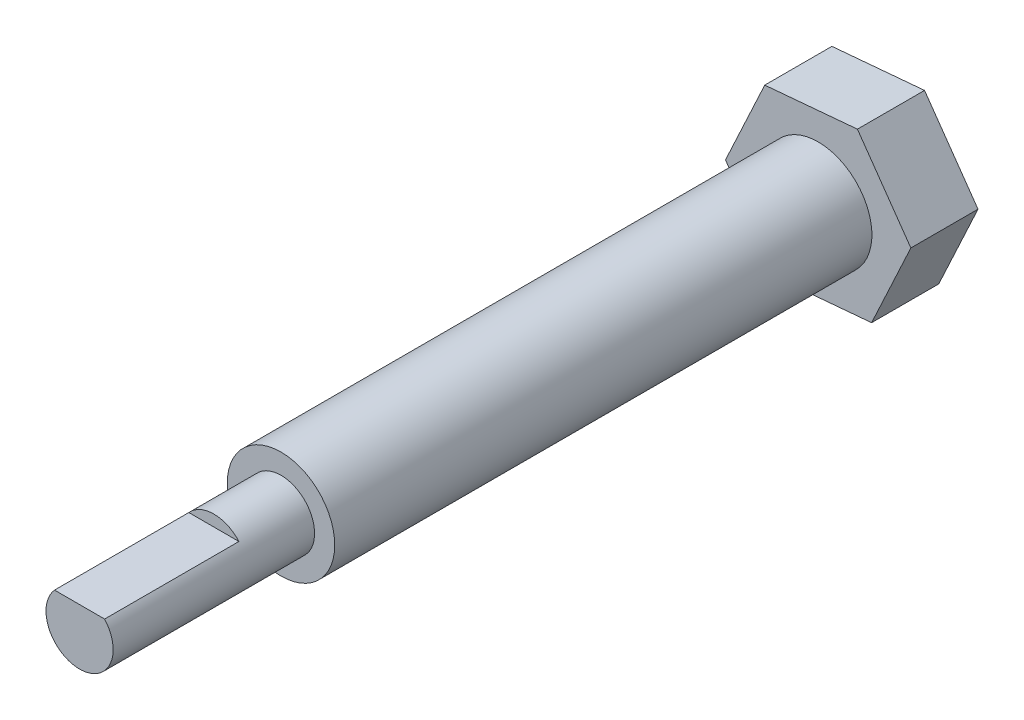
ISO-10303-21;
HEADER;
FILE_DESCRIPTION(('STEP AP214'),'2;1');
FILE_NAME('part.step','',(''),(''),'','','');
FILE_SCHEMA(('AUTOMOTIVE_DESIGN { 1 0 10303 214 1 1 1 1 }'));
ENDSEC;
DATA;
#1=APPLICATION_CONTEXT('core data for automotive mechanical design processes');
#2=APPLICATION_PROTOCOL_DEFINITION('international standard','automotive_design',2000,#1);
#3=PRODUCT_CONTEXT('',#1,'mechanical');
#4=PRODUCT('Part','Part','',(#3));
#5=PRODUCT_RELATED_PRODUCT_CATEGORY('part','',(#4));
#6=PRODUCT_DEFINITION_FORMATION('','',#4);
#7=PRODUCT_DEFINITION_CONTEXT('part definition',#1,'design');
#8=PRODUCT_DEFINITION('design','',#6,#7);
#9=PRODUCT_DEFINITION_SHAPE('','',#8);
#10=(LENGTH_UNIT() NAMED_UNIT(*) SI_UNIT(.MILLI.,.METRE.));
#11=(NAMED_UNIT(*) PLANE_ANGLE_UNIT() SI_UNIT($,.RADIAN.));
#12=(NAMED_UNIT(*) SI_UNIT($,.STERADIAN.) SOLID_ANGLE_UNIT());
#13=UNCERTAINTY_MEASURE_WITH_UNIT(LENGTH_MEASURE(1.E-05),#10,'distance_accuracy_value','');
#14=(GEOMETRIC_REPRESENTATION_CONTEXT(3) GLOBAL_UNCERTAINTY_ASSIGNED_CONTEXT((#13)) GLOBAL_UNIT_ASSIGNED_CONTEXT((#10,
#11,#12)) REPRESENTATION_CONTEXT('',''));
#15=CARTESIAN_POINT('',(0.,0.,0.));
#16=DIRECTION('',(0.,0.,1.));
#17=DIRECTION('',(1.,0.,0.));
#18=AXIS2_PLACEMENT_3D('',#15,#16,#17);
#19=CARTESIAN_POINT('',(0.,0.,69.85));
#20=DIRECTION('',(0.,0.,-1.));
#21=DIRECTION('',(-1.,0.,0.));
#22=AXIS2_PLACEMENT_3D('',#19,#20,#21);
#23=CYLINDRICAL_SURFACE('',#22,3.175);
#24=CARTESIAN_POINT('',(0.,0.,69.85));
#25=DIRECTION('',(0.,0.,1.));
#26=DIRECTION('',(1.,0.,0.));
#27=AXIS2_PLACEMENT_3D('',#24,#25,#26);
#28=CIRCLE('',#27,3.175);
#29=CARTESIAN_POINT('',(-2.37033025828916,2.11238241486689,69.85));
#30=VERTEX_POINT('',#29);
#31=CARTESIAN_POINT('',(2.37033025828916,2.11238241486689,69.85));
#32=VERTEX_POINT('',#31);
#33=EDGE_CURVE('E139',#30,#32,#28,.T.);
#34=ORIENTED_EDGE('',*,*,#33,.F.);
#35=DIRECTION('',(0.,0.,-1.));
#36=VECTOR('',#35,1.);
#37=CARTESIAN_POINT('',(-2.37033025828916,2.11238241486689,69.85));
#38=LINE('',#37,#36);
#39=CARTESIAN_POINT('',(-2.37033025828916,2.11238241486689,57.15));
#40=VERTEX_POINT('',#39);
#41=EDGE_CURVE('E47',#30,#40,#38,.T.);
#42=ORIENTED_EDGE('',*,*,#41,.T.);
#43=CARTESIAN_POINT('',(0.,0.,57.15));
#44=DIRECTION('',(0.,0.,1.));
#45=DIRECTION('',(1.,0.,0.));
#46=AXIS2_PLACEMENT_3D('',#43,#44,#45);
#47=CIRCLE('',#46,3.175);
#48=CARTESIAN_POINT('',(2.37033025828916,2.11238241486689,57.15));
#49=VERTEX_POINT('',#48);
#50=EDGE_CURVE('E11',#49,#40,#47,.T.);
#51=ORIENTED_EDGE('',*,*,#50,.F.);
#52=DIRECTION('',(0.,0.,-1.));
#53=VECTOR('',#52,1.);
#54=CARTESIAN_POINT('',(2.37033025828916,2.11238241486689,69.85));
#55=LINE('',#54,#53);
#56=EDGE_CURVE('E52',#49,#32,#55,.F.);
#57=ORIENTED_EDGE('',*,*,#56,.T.);
#58=EDGE_LOOP('',(#34,#42,#51,#57));
#59=FACE_BOUND('',#58,.T.);
#60=CARTESIAN_POINT('',(0.,0.,50.8));
#61=DIRECTION('',(0.,0.,-1.));
#62=DIRECTION('',(-1.,0.,0.));
#63=AXIS2_PLACEMENT_3D('',#60,#61,#62);
#64=CIRCLE('',#63,3.175);
#65=CARTESIAN_POINT('',(-3.175,0.,50.8));
#66=VERTEX_POINT('',#65);
#67=EDGE_CURVE('E132',#66,#66,#64,.T.);
#68=ORIENTED_EDGE('',*,*,#67,.F.);
#69=EDGE_LOOP('',(#68));
#70=FACE_BOUND('',#69,.T.);
#71=ADVANCED_FACE('F33',(#59,#70),#23,.T.);
#72=CARTESIAN_POINT('',(0.,0.,69.85));
#73=DIRECTION('',(0.,0.,1.));
#74=DIRECTION('',(1.,0.,0.));
#75=AXIS2_PLACEMENT_3D('',#72,#73,#74);
#76=PLANE('',#75);
#77=DIRECTION('',(1.,0.,0.));
#78=VECTOR('',#77,1.);
#79=CARTESIAN_POINT('',(0.,2.11238241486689,69.85));
#80=LINE('',#79,#78);
#81=EDGE_CURVE('E40',#30,#32,#80,.T.);
#82=ORIENTED_EDGE('',*,*,#81,.F.);
#83=ORIENTED_EDGE('',*,*,#33,.T.);
#84=EDGE_LOOP('',(#82,#83));
#85=FACE_BOUND('',#84,.T.);
#86=ADVANCED_FACE('F147',(#85),#76,.T.);
#87=CARTESIAN_POINT('',(0.,0.,57.15));
#88=DIRECTION('',(0.,0.,1.));
#89=DIRECTION('',(1.,0.,0.));
#90=AXIS2_PLACEMENT_3D('',#87,#88,#89);
#91=PLANE('',#90);
#92=ORIENTED_EDGE('',*,*,#50,.T.);
#93=DIRECTION('',(1.,0.,0.));
#94=VECTOR('',#93,1.);
#95=CARTESIAN_POINT('',(-3.63177070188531,2.11238241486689,57.15));
#96=LINE('',#95,#94);
#97=EDGE_CURVE('E135',#40,#49,#96,.T.);
#98=ORIENTED_EDGE('',*,*,#97,.T.);
#99=EDGE_LOOP('',(#92,#98));
#100=FACE_BOUND('',#99,.T.);
#101=ADVANCED_FACE('F149',(#100),#91,.T.);
#102=CARTESIAN_POINT('',(-3.63177070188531,2.11238241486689,57.15));
#103=DIRECTION('',(0.,-1.,0.));
#104=DIRECTION('',(0.,0.,-1.));
#105=AXIS2_PLACEMENT_3D('',#102,#103,#104);
#106=PLANE('',#105);
#107=ORIENTED_EDGE('',*,*,#81,.T.);
#108=ORIENTED_EDGE('',*,*,#56,.F.);
#109=ORIENTED_EDGE('',*,*,#97,.F.);
#110=ORIENTED_EDGE('',*,*,#41,.F.);
#111=EDGE_LOOP('',(#107,#108,#109,#110));
#112=FACE_BOUND('',#111,.T.);
#113=ADVANCED_FACE('F141',(#112),#106,.F.);
#114=CARTESIAN_POINT('',(0.,0.,50.8));
#115=DIRECTION('',(0.,0.,1.));
#116=DIRECTION('',(1.,0.,0.));
#117=AXIS2_PLACEMENT_3D('',#114,#115,#116);
#118=PLANE('',#117);
#119=CARTESIAN_POINT('',(0.,0.,50.8));
#120=DIRECTION('',(0.,0.,1.));
#121=DIRECTION('',(1.,0.,0.));
#122=AXIS2_PLACEMENT_3D('',#119,#120,#121);
#123=CIRCLE('',#122,5.08);
#124=CARTESIAN_POINT('',(5.08,0.,50.8));
#125=VERTEX_POINT('',#124);
#126=EDGE_CURVE('E124',#125,#125,#123,.T.);
#127=ORIENTED_EDGE('',*,*,#126,.T.);
#128=EDGE_LOOP('',(#127));
#129=FACE_BOUND('',#128,.T.);
#130=ORIENTED_EDGE('',*,*,#67,.T.);
#131=EDGE_LOOP('',(#130));
#132=FACE_BOUND('',#131,.T.);
#133=ADVANCED_FACE('F159',(#129,#132),#118,.T.);
#134=CARTESIAN_POINT('',(0.,0.,50.8));
#135=DIRECTION('',(0.,0.,-1.));
#136=DIRECTION('',(-1.,0.,0.));
#137=AXIS2_PLACEMENT_3D('',#134,#135,#136);
#138=CYLINDRICAL_SURFACE('',#137,5.08);
#139=ORIENTED_EDGE('',*,*,#126,.F.);
#140=EDGE_LOOP('',(#139));
#141=FACE_BOUND('',#140,.T.);
#142=CARTESIAN_POINT('',(0.,0.,0.));
#143=DIRECTION('',(0.,0.,-1.));
#144=DIRECTION('',(-1.,0.,0.));
#145=AXIS2_PLACEMENT_3D('',#142,#143,#144);
#146=CIRCLE('',#145,5.08);
#147=CARTESIAN_POINT('',(-5.08,0.,0.));
#148=VERTEX_POINT('',#147);
#149=EDGE_CURVE('E121',#148,#148,#146,.T.);
#150=ORIENTED_EDGE('',*,*,#149,.F.);
#151=EDGE_LOOP('',(#150));
#152=FACE_BOUND('',#151,.T.);
#153=ADVANCED_FACE('F161',(#141,#152),#138,.T.);
#154=CARTESIAN_POINT('',(0.,0.,0.));
#155=DIRECTION('',(0.,0.,-1.));
#156=DIRECTION('',(-1.,0.,0.));
#157=AXIS2_PLACEMENT_3D('',#154,#155,#156);
#158=PLANE('',#157);
#159=DIRECTION('',(-0.996112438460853,-0.0880909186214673,0.));
#160=VECTOR('',#159,1.);
#161=CARTESIAN_POINT('',(5.05355887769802,-7.20282879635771,0.));
#162=LINE('',#161,#160);
#163=CARTESIAN_POINT('',(5.05355887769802,-7.20282879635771,0.));
#164=VERTEX_POINT('',#163);
#165=CARTESIAN_POINT('',(-3.71105327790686,-7.97792476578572,0.));
#166=VERTEX_POINT('',#165);
#167=EDGE_CURVE('E120',#164,#166,#162,.T.);
#168=ORIENTED_EDGE('',*,*,#167,.F.);
#169=DIRECTION('',(-0.421767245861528,-0.906704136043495,0.));
#170=VECTOR('',#169,1.);
#171=CARTESIAN_POINT('',(8.76461215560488,0.775095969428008,0.));
#172=LINE('',#171,#170);
#173=CARTESIAN_POINT('',(8.76461215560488,0.775095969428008,0.));
#174=VERTEX_POINT('',#173);
#175=EDGE_CURVE('E116',#174,#164,#172,.T.);
#176=ORIENTED_EDGE('',*,*,#175,.F.);
#177=DIRECTION('',(0.574345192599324,-0.818613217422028,0.));
#178=VECTOR('',#177,1.);
#179=CARTESIAN_POINT('',(3.71105327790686,7.97792476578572,0.));
#180=LINE('',#179,#178);
#181=CARTESIAN_POINT('',(3.71105327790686,7.97792476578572,0.));
#182=VERTEX_POINT('',#181);
#183=EDGE_CURVE('E290',#182,#174,#180,.T.);
#184=ORIENTED_EDGE('',*,*,#183,.F.);
#185=DIRECTION('',(0.996112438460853,0.0880909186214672,0.));
#186=VECTOR('',#185,1.);
#187=CARTESIAN_POINT('',(-5.05355887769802,7.20282879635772,0.));
#188=LINE('',#187,#186);
#189=CARTESIAN_POINT('',(-5.05355887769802,7.20282879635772,0.));
#190=VERTEX_POINT('',#189);
#191=EDGE_CURVE('E288',#190,#182,#188,.T.);
#192=ORIENTED_EDGE('',*,*,#191,.F.);
#193=DIRECTION('',(0.421767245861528,0.906704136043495,0.));
#194=VECTOR('',#193,1.);
#195=CARTESIAN_POINT('',(-8.76461215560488,-0.775095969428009,0.));
#196=LINE('',#195,#194);
#197=CARTESIAN_POINT('',(-8.76461215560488,-0.775095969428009,0.));
#198=VERTEX_POINT('',#197);
#199=EDGE_CURVE('E282',#198,#190,#196,.T.);
#200=ORIENTED_EDGE('',*,*,#199,.F.);
#201=DIRECTION('',(-0.574345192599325,0.818613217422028,0.));
#202=VECTOR('',#201,1.);
#203=CARTESIAN_POINT('',(-3.71105327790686,-7.97792476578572,0.));
#204=LINE('',#203,#202);
#205=EDGE_CURVE('E280',#166,#198,#204,.T.);
#206=ORIENTED_EDGE('',*,*,#205,.F.);
#207=EDGE_LOOP('',(#168,#176,#184,#192,#200,#206));
#208=FACE_BOUND('',#207,.T.);
#209=ORIENTED_EDGE('',*,*,#149,.T.);
#210=EDGE_LOOP('',(#209));
#211=FACE_BOUND('',#210,.T.);
#212=ADVANCED_FACE('F164',(#208,#211),#158,.F.);
#213=CARTESIAN_POINT('',(5.05355887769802,-7.20282879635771,-6.35));
#214=DIRECTION('',(-0.0880909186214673,0.996112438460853,0.));
#215=DIRECTION('',(-0.996112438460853,-0.0880909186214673,0.));
#216=AXIS2_PLACEMENT_3D('',#213,#214,#215);
#217=PLANE('',#216);
#218=ORIENTED_EDGE('',*,*,#167,.T.);
#219=DIRECTION('',(0.,0.,1.));
#220=VECTOR('',#219,1.);
#221=CARTESIAN_POINT('',(-3.71105327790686,-7.97792476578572,-6.35));
#222=LINE('',#221,#220);
#223=CARTESIAN_POINT('',(-3.71105327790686,-7.97792476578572,-6.35));
#224=VERTEX_POINT('',#223);
#225=EDGE_CURVE('E100',#224,#166,#222,.T.);
#226=ORIENTED_EDGE('',*,*,#225,.F.);
#227=DIRECTION('',(-0.996112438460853,-0.0880909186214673,0.));
#228=VECTOR('',#227,1.);
#229=CARTESIAN_POINT('',(5.05355887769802,-7.20282879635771,-6.35));
#230=LINE('',#229,#228);
#231=CARTESIAN_POINT('',(5.05355887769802,-7.20282879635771,-6.35));
#232=VERTEX_POINT('',#231);
#233=EDGE_CURVE('E107',#232,#224,#230,.T.);
#234=ORIENTED_EDGE('',*,*,#233,.F.);
#235=DIRECTION('',(0.,0.,1.));
#236=VECTOR('',#235,1.);
#237=CARTESIAN_POINT('',(5.05355887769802,-7.20282879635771,-6.35));
#238=LINE('',#237,#236);
#239=EDGE_CURVE('E293',#232,#164,#238,.T.);
#240=ORIENTED_EDGE('',*,*,#239,.T.);
#241=EDGE_LOOP('',(#218,#226,#234,#240));
#242=FACE_BOUND('',#241,.T.);
#243=ADVANCED_FACE('F118',(#242),#217,.F.);
#244=CARTESIAN_POINT('',(-3.71105327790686,-7.97792476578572,-6.35));
#245=DIRECTION('',(0.818613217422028,0.574345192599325,0.));
#246=DIRECTION('',(-0.574345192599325,0.818613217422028,0.));
#247=AXIS2_PLACEMENT_3D('',#244,#245,#246);
#248=PLANE('',#247);
#249=ORIENTED_EDGE('',*,*,#205,.T.);
#250=DIRECTION('',(0.,0.,1.));
#251=VECTOR('',#250,1.);
#252=CARTESIAN_POINT('',(-8.76461215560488,-0.775095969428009,-6.35));
#253=LINE('',#252,#251);
#254=CARTESIAN_POINT('',(-8.76461215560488,-0.775095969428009,-6.35));
#255=VERTEX_POINT('',#254);
#256=EDGE_CURVE('E103',#255,#198,#253,.T.);
#257=ORIENTED_EDGE('',*,*,#256,.F.);
#258=DIRECTION('',(-0.574345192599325,0.818613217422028,0.));
#259=VECTOR('',#258,1.);
#260=CARTESIAN_POINT('',(-3.71105327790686,-7.97792476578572,-6.35));
#261=LINE('',#260,#259);
#262=EDGE_CURVE('E96',#224,#255,#261,.T.);
#263=ORIENTED_EDGE('',*,*,#262,.F.);
#264=ORIENTED_EDGE('',*,*,#225,.T.);
#265=EDGE_LOOP('',(#249,#257,#263,#264));
#266=FACE_BOUND('',#265,.T.);
#267=ADVANCED_FACE('F98',(#266),#248,.F.);
#268=CARTESIAN_POINT('',(-8.76461215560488,-0.775095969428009,-6.35));
#269=DIRECTION('',(0.906704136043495,-0.421767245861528,0.));
#270=DIRECTION('',(0.421767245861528,0.906704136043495,0.));
#271=AXIS2_PLACEMENT_3D('',#268,#269,#270);
#272=PLANE('',#271);
#273=ORIENTED_EDGE('',*,*,#199,.T.);
#274=DIRECTION('',(0.,0.,1.));
#275=VECTOR('',#274,1.);
#276=CARTESIAN_POINT('',(-5.05355887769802,7.20282879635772,-6.35));
#277=LINE('',#276,#275);
#278=CARTESIAN_POINT('',(-5.05355887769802,7.20282879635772,-6.35));
#279=VERTEX_POINT('',#278);
#280=EDGE_CURVE('E126',#279,#190,#277,.T.);
#281=ORIENTED_EDGE('',*,*,#280,.F.);
#282=DIRECTION('',(0.421767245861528,0.906704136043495,0.));
#283=VECTOR('',#282,1.);
#284=CARTESIAN_POINT('',(-8.76461215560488,-0.775095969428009,-6.35));
#285=LINE('',#284,#283);
#286=EDGE_CURVE('E106',#255,#279,#285,.T.);
#287=ORIENTED_EDGE('',*,*,#286,.F.);
#288=ORIENTED_EDGE('',*,*,#256,.T.);
#289=EDGE_LOOP('',(#273,#281,#287,#288));
#290=FACE_BOUND('',#289,.T.);
#291=ADVANCED_FACE('F173',(#290),#272,.F.);
#292=CARTESIAN_POINT('',(-5.05355887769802,7.20282879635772,-6.35));
#293=DIRECTION('',(0.0880909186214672,-0.996112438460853,0.));
#294=DIRECTION('',(0.996112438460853,0.0880909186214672,0.));
#295=AXIS2_PLACEMENT_3D('',#292,#293,#294);
#296=PLANE('',#295);
#297=ORIENTED_EDGE('',*,*,#191,.T.);
#298=DIRECTION('',(0.,0.,1.));
#299=VECTOR('',#298,1.);
#300=CARTESIAN_POINT('',(3.71105327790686,7.97792476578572,-6.35));
#301=LINE('',#300,#299);
#302=CARTESIAN_POINT('',(3.71105327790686,7.97792476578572,-6.35));
#303=VERTEX_POINT('',#302);
#304=EDGE_CURVE('E298',#303,#182,#301,.T.);
#305=ORIENTED_EDGE('',*,*,#304,.F.);
#306=DIRECTION('',(0.996112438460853,0.0880909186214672,0.));
#307=VECTOR('',#306,1.);
#308=CARTESIAN_POINT('',(-5.05355887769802,7.20282879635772,-6.35));
#309=LINE('',#308,#307);
#310=EDGE_CURVE('E305',#279,#303,#309,.T.);
#311=ORIENTED_EDGE('',*,*,#310,.F.);
#312=ORIENTED_EDGE('',*,*,#280,.T.);
#313=EDGE_LOOP('',(#297,#305,#311,#312));
#314=FACE_BOUND('',#313,.T.);
#315=ADVANCED_FACE('F176',(#314),#296,.F.);
#316=CARTESIAN_POINT('',(3.71105327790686,7.97792476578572,-6.35));
#317=DIRECTION('',(-0.818613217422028,-0.574345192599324,0.));
#318=DIRECTION('',(0.574345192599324,-0.818613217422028,0.));
#319=AXIS2_PLACEMENT_3D('',#316,#317,#318);
#320=PLANE('',#319);
#321=ORIENTED_EDGE('',*,*,#183,.T.);
#322=DIRECTION('',(0.,0.,1.));
#323=VECTOR('',#322,1.);
#324=CARTESIAN_POINT('',(8.76461215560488,0.775095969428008,-6.35));
#325=LINE('',#324,#323);
#326=CARTESIAN_POINT('',(8.76461215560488,0.775095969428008,-6.35));
#327=VERTEX_POINT('',#326);
#328=EDGE_CURVE('E295',#327,#174,#325,.T.);
#329=ORIENTED_EDGE('',*,*,#328,.F.);
#330=DIRECTION('',(0.574345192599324,-0.818613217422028,0.));
#331=VECTOR('',#330,1.);
#332=CARTESIAN_POINT('',(3.71105327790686,7.97792476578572,-6.35));
#333=LINE('',#332,#331);
#334=EDGE_CURVE('E308',#303,#327,#333,.T.);
#335=ORIENTED_EDGE('',*,*,#334,.F.);
#336=ORIENTED_EDGE('',*,*,#304,.T.);
#337=EDGE_LOOP('',(#321,#329,#335,#336));
#338=FACE_BOUND('',#337,.T.);
#339=ADVANCED_FACE('F180',(#338),#320,.F.);
#340=CARTESIAN_POINT('',(8.76461215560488,0.775095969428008,-6.35));
#341=DIRECTION('',(-0.906704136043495,0.421767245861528,0.));
#342=DIRECTION('',(-0.421767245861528,-0.906704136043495,0.));
#343=AXIS2_PLACEMENT_3D('',#340,#341,#342);
#344=PLANE('',#343);
#345=ORIENTED_EDGE('',*,*,#175,.T.);
#346=ORIENTED_EDGE('',*,*,#239,.F.);
#347=DIRECTION('',(-0.421767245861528,-0.906704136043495,0.));
#348=VECTOR('',#347,1.);
#349=CARTESIAN_POINT('',(8.76461215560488,0.775095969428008,-6.35));
#350=LINE('',#349,#348);
#351=EDGE_CURVE('E112',#327,#232,#350,.T.);
#352=ORIENTED_EDGE('',*,*,#351,.F.);
#353=ORIENTED_EDGE('',*,*,#328,.T.);
#354=EDGE_LOOP('',(#345,#346,#352,#353));
#355=FACE_BOUND('',#354,.T.);
#356=ADVANCED_FACE('F184',(#355),#344,.F.);
#357=CARTESIAN_POINT('',(0.,0.,-6.35));
#358=DIRECTION('',(0.,0.,-1.));
#359=DIRECTION('',(-1.,0.,0.));
#360=AXIS2_PLACEMENT_3D('',#357,#358,#359);
#361=PLANE('',#360);
#362=ORIENTED_EDGE('',*,*,#233,.T.);
#363=ORIENTED_EDGE('',*,*,#262,.T.);
#364=ORIENTED_EDGE('',*,*,#286,.T.);
#365=ORIENTED_EDGE('',*,*,#310,.T.);
#366=ORIENTED_EDGE('',*,*,#334,.T.);
#367=ORIENTED_EDGE('',*,*,#351,.T.);
#368=EDGE_LOOP('',(#362,#363,#364,#365,#366,#367));
#369=FACE_BOUND('',#368,.T.);
#370=ADVANCED_FACE('F110',(#369),#361,.T.);
#371=CLOSED_SHELL('',(#71,#86,#101,#113,#133,#153,#212,#243,#267,#291,#315,#339,#356,#370));
#372=MANIFOLD_SOLID_BREP('B2',#371);
#373=ADVANCED_BREP_SHAPE_REPRESENTATION('',(#18,#372),#14);
#374=SHAPE_DEFINITION_REPRESENTATION(#9,#373);
ENDSEC;
END-ISO-10303-21;
